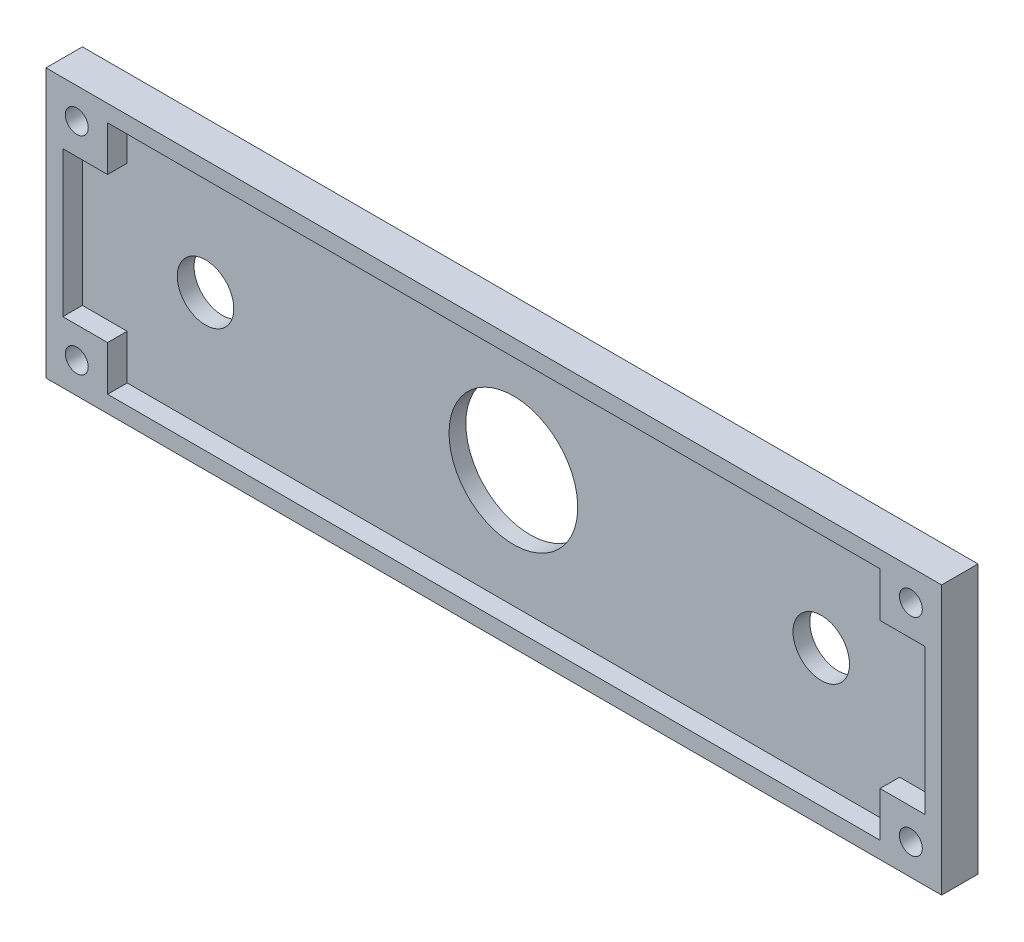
from build123d import *

# Parameters (mm, degrees)
SKIZZE1_W                       = 160
SKIZZE1_H                       = 48
AUFSATZ_LINEAR_AUSTRAGEN1_DEPTH = 6.5
SCHNITT_LINEAR_AUSTRAGEN1_DEPTH = 3.5
SKIZZE3_R                       = 2.05
SCHNITT_LINEAR_AUSTRAGEN2_DEPTH = 10
SKIZZE4_R                       = 4
SCHNITT_LINEAR_AUSTRAGEN3_DEPTH = 3.5
SKIZZE5_R                       = 11.5
SKIZZE5_R_2                     = 5.05
SCHNITT_LINEAR_AUSTRAGEN4_DEPTH = 3.5


with BuildPart() as part:
    # Skizze1 → Aufsatz-Linear austragen1 (new body)
    with BuildSketch(Plane.XY):
        with Locations((-1.056274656, 0)):
            Rectangle(SKIZZE1_W, SKIZZE1_H)
    extrude(amount=AUFSATZ_LINEAR_AUSTRAGEN1_DEPTH)

    # Skizze2 → Schnitt-Linear austragen1 (cut)
    with BuildSketch(Plane.XY.offset(6.5)):
        Polygon((-70.056274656, 21), (67.943725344, 21), (67.943725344, 13), (75.943725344, 13), (75.943725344, -13), (67.943725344, -13), (67.943725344, -21), (-70.056274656, -21), (-70.056274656, -13), (-78.056274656, -13), (-78.056274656, 13), (-70.056274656, 13), align=None)
    extrude(amount=-SCHNITT_LINEAR_AUSTRAGEN1_DEPTH, mode=Mode.SUBTRACT)

    # Skizze3 → Schnitt-Linear austragen2 (cut)
    with BuildSketch(Plane(origin=(0, 0, 0), x_dir=(-1, 0, 0), z_dir=(0, 0, -1))):
        with Locations((-73.443725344, 18.5)):
            Circle(SKIZZE3_R)
        with Locations(Location((75.556274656, 18.5, 0), (0, 0, 180))):
            Circle(SKIZZE3_R)
        with Locations((75.556274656, -18.5)):
            Circle(SKIZZE3_R)
        with Locations(Location((-73.443725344, -18.5, 0), (0, 0, 180))):
            Circle(SKIZZE3_R)
    extrude(amount=-SCHNITT_LINEAR_AUSTRAGEN2_DEPTH, mode=Mode.SUBTRACT)

    # Skizze4 → Schnitt-Linear austragen3 (cut)
    with BuildSketch(Plane(origin=(0, 0, 0), x_dir=(-1, 0, 0), z_dir=(0, 0, -1))):
        with Locations((-73.443725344, 18.5)):
            Circle(SKIZZE4_R)
        with Locations(Location((75.556274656, 18.5, 0), (0, 0, 180))):
            Circle(SKIZZE4_R)
        with Locations((75.556274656, -18.5)):
            Circle(SKIZZE4_R)
        with Locations(Location((-73.443725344, -18.5, 0), (0, 0, 180))):
            Circle(SKIZZE4_R)
    extrude(amount=-SCHNITT_LINEAR_AUSTRAGEN3_DEPTH, mode=Mode.SUBTRACT)

    # Skizze5 → Schnitt-Linear austragen4 (cut)
    with BuildSketch(Plane(origin=(0, 0, 0), x_dir=(-1, 0, 0), z_dir=(0, 0, -1))):
        with Locations((1.056274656, 0)):
            Circle(SKIZZE5_R)
        with Locations((-53.943725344, 0)):
            Circle(SKIZZE5_R_2)
        with Locations((56.056274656, 0)):
            Circle(SKIZZE5_R_2)
    extrude(amount=-SCHNITT_LINEAR_AUSTRAGEN4_DEPTH, mode=Mode.SUBTRACT)


solid = part.part
